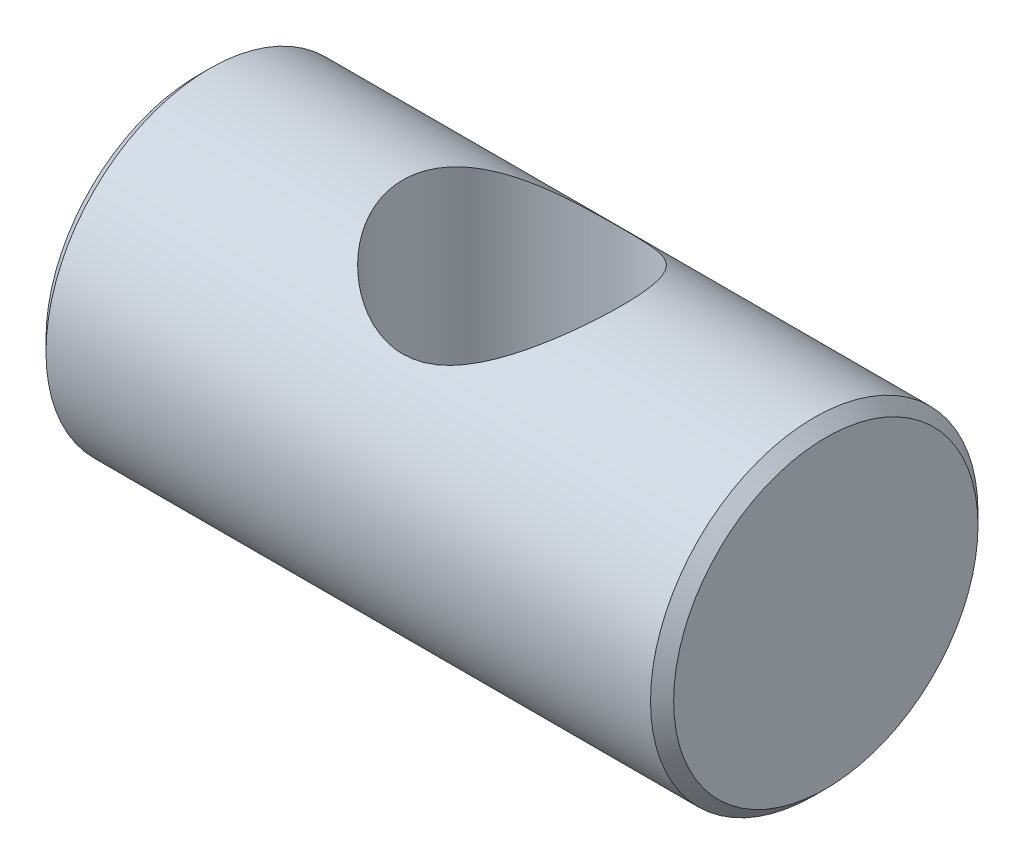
ISO-10303-21;
HEADER;
FILE_DESCRIPTION(('STEP AP214'),'2;1');
FILE_NAME('part.step','',(''),(''),'','','');
FILE_SCHEMA(('AUTOMOTIVE_DESIGN { 1 0 10303 214 1 1 1 1 }'));
ENDSEC;
DATA;
#1=APPLICATION_CONTEXT('core data for automotive mechanical design processes');
#2=APPLICATION_PROTOCOL_DEFINITION('international standard','automotive_design',2000,#1);
#3=PRODUCT_CONTEXT('',#1,'mechanical');
#4=PRODUCT('Part','Part','',(#3));
#5=PRODUCT_RELATED_PRODUCT_CATEGORY('part','',(#4));
#6=PRODUCT_DEFINITION_FORMATION('','',#4);
#7=PRODUCT_DEFINITION_CONTEXT('part definition',#1,'design');
#8=PRODUCT_DEFINITION('design','',#6,#7);
#9=PRODUCT_DEFINITION_SHAPE('','',#8);
#10=(LENGTH_UNIT() NAMED_UNIT(*) SI_UNIT(.MILLI.,.METRE.));
#11=(NAMED_UNIT(*) PLANE_ANGLE_UNIT() SI_UNIT($,.RADIAN.));
#12=(NAMED_UNIT(*) SI_UNIT($,.STERADIAN.) SOLID_ANGLE_UNIT());
#13=UNCERTAINTY_MEASURE_WITH_UNIT(LENGTH_MEASURE(1.E-05),#10,'distance_accuracy_value','');
#14=(GEOMETRIC_REPRESENTATION_CONTEXT(3) GLOBAL_UNCERTAINTY_ASSIGNED_CONTEXT((#13)) GLOBAL_UNIT_ASSIGNED_CONTEXT((#10,
#11,#12)) REPRESENTATION_CONTEXT('',''));
#15=CARTESIAN_POINT('',(0.,0.,0.));
#16=DIRECTION('',(0.,0.,1.));
#17=DIRECTION('',(1.,0.,0.));
#18=AXIS2_PLACEMENT_3D('',#15,#16,#17);
#19=CARTESIAN_POINT('',(5.75,2.78786796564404,0.));
#20=DIRECTION('',(-1.,0.,0.));
#21=DIRECTION('',(0.,0.,1.));
#22=AXIS2_PLACEMENT_3D('',#19,#20,#21);
#23=PLANE('',#22);
#24=CARTESIAN_POINT('',(5.74999999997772,0.,0.));
#25=DIRECTION('',(-1.,0.,0.));
#26=DIRECTION('',(0.,0.,1.));
#27=AXIS2_PLACEMENT_3D('',#24,#25,#26);
#28=CIRCLE('',#27,2.78786796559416);
#29=CARTESIAN_POINT('',(5.74999999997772,0.,2.78786796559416));
#30=VERTEX_POINT('',#29);
#31=EDGE_CURVE('E43',#30,#30,#28,.T.);
#32=ORIENTED_EDGE('',*,*,#31,.F.);
#33=EDGE_LOOP('',(#32));
#34=FACE_BOUND('',#33,.T.);
#35=ADVANCED_FACE('F12',(#34),#23,.F.);
#36=CARTESIAN_POINT('',(-5.75,0.,0.));
#37=DIRECTION('',(1.,0.,0.));
#38=DIRECTION('',(0.,0.,-1.));
#39=AXIS2_PLACEMENT_3D('',#36,#37,#38);
#40=PLANE('',#39);
#41=CARTESIAN_POINT('',(-5.75000000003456,0.,0.));
#42=DIRECTION('',(1.,0.,0.));
#43=DIRECTION('',(0.,0.,-1.));
#44=AXIS2_PLACEMENT_3D('',#41,#42,#43);
#45=CIRCLE('',#44,2.78786796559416);
#46=CARTESIAN_POINT('',(-5.75000000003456,0.,-2.78786796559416));
#47=VERTEX_POINT('',#46);
#48=EDGE_CURVE('E70',#47,#47,#45,.T.);
#49=ORIENTED_EDGE('',*,*,#48,.F.);
#50=EDGE_LOOP('',(#49));
#51=FACE_BOUND('',#50,.T.);
#52=ADVANCED_FACE('F59',(#51),#40,.F.);
#53=CARTESIAN_POINT('',(5.53786796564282,0.,0.));
#54=DIRECTION('',(-1.,0.,0.));
#55=DIRECTION('',(0.,0.,1.));
#56=AXIS2_PLACEMENT_3D('',#53,#54,#55);
#57=CONICAL_SURFACE('',#56,2.99999999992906,0.785398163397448);
#58=CARTESIAN_POINT('',(5.53786796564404,0.,0.));
#59=DIRECTION('',(1.,0.,0.));
#60=DIRECTION('',(0.,0.,-1.));
#61=AXIS2_PLACEMENT_3D('',#58,#59,#60);
#62=CIRCLE('',#61,3.);
#63=CARTESIAN_POINT('',(5.53786796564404,0.,-3.));
#64=VERTEX_POINT('',#63);
#65=EDGE_CURVE('E37',#64,#64,#62,.F.);
#66=ORIENTED_EDGE('',*,*,#65,.F.);
#67=EDGE_LOOP('',(#66));
#68=FACE_BOUND('',#67,.T.);
#69=ORIENTED_EDGE('',*,*,#31,.T.);
#70=EDGE_LOOP('',(#69));
#71=FACE_BOUND('',#70,.T.);
#72=ADVANCED_FACE('F64',(#68,#71),#57,.T.);
#73=CARTESIAN_POINT('',(-5.53786796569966,0.,0.));
#74=DIRECTION('',(1.,0.,0.));
#75=DIRECTION('',(0.,0.,-1.));
#76=AXIS2_PLACEMENT_3D('',#73,#74,#75);
#77=CONICAL_SURFACE('',#76,2.99999999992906,0.785398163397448);
#78=ORIENTED_EDGE('',*,*,#48,.T.);
#79=EDGE_LOOP('',(#78));
#80=FACE_BOUND('',#79,.T.);
#81=CARTESIAN_POINT('',(-5.53786796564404,0.,0.));
#82=DIRECTION('',(1.,0.,0.));
#83=DIRECTION('',(0.,0.,-1.));
#84=AXIS2_PLACEMENT_3D('',#81,#82,#83);
#85=CIRCLE('',#84,3.);
#86=CARTESIAN_POINT('',(-5.53786796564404,0.,-3.));
#87=VERTEX_POINT('',#86);
#88=EDGE_CURVE('E31',#87,#87,#85,.T.);
#89=ORIENTED_EDGE('',*,*,#88,.F.);
#90=EDGE_LOOP('',(#89));
#91=FACE_BOUND('',#90,.T.);
#92=ADVANCED_FACE('F56',(#80,#91),#77,.T.);
#93=CARTESIAN_POINT('',(5.75,0.,0.));
#94=DIRECTION('',(1.,0.,0.));
#95=DIRECTION('',(0.,0.,-1.));
#96=AXIS2_PLACEMENT_3D('',#93,#94,#95);
#97=CYLINDRICAL_SURFACE('',#96,3.);
#98=CARTESIAN_POINT('',(2.,-3.,0.));
#99=CARTESIAN_POINT('',(2.00000054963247,-3.0000004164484,0.100484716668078));
#100=CARTESIAN_POINT('',(1.9923860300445,-2.99490802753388,0.200969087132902));
#101=CARTESIAN_POINT('',(1.96240313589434,-2.97504652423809,0.398733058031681));
#102=CARTESIAN_POINT('',(1.9400277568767,-2.96027281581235,0.496011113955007));
#103=CARTESIAN_POINT('',(1.88189228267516,-2.92250482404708,0.684212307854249));
#104=CARTESIAN_POINT('',(1.84619485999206,-2.89954905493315,0.775162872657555));
#105=CARTESIAN_POINT('',(1.7629366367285,-2.8472613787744,0.949415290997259));
#106=CARTESIAN_POINT('',(1.71537411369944,-2.8179285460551,1.03271603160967));
#107=CARTESIAN_POINT('',(1.60534306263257,-2.75227329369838,1.19728470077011));
#108=CARTESIAN_POINT('',(1.54195213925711,-2.71556897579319,1.27778030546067));
#109=CARTESIAN_POINT('',(1.40426995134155,-2.63982313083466,1.42772804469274));
#110=CARTESIAN_POINT('',(1.32996307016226,-2.60077830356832,1.49716405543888));
#111=CARTESIAN_POINT('',(1.15894763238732,-2.51728264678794,1.63422297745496));
#112=CARTESIAN_POINT('',(1.06055434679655,-2.47295067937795,1.6998318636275));
#113=CARTESIAN_POINT('',(0.85163662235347,-2.3908414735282,1.81350357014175));
#114=CARTESIAN_POINT('',(0.741133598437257,-2.35305295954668,1.86159673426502));
#115=CARTESIAN_POINT('',(0.543288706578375,-2.29976266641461,1.92674035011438));
#116=CARTESIAN_POINT('',(0.458471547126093,-2.28097627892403,1.94874447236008));
#117=CARTESIAN_POINT('',(0.285255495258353,-2.25257969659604,1.98150617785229));
#118=CARTESIAN_POINT('',(0.19686305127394,-2.24295368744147,1.99228314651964));
#119=CARTESIAN_POINT('',(0.0185252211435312,-2.23436605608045,2.00191364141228));
#120=CARTESIAN_POINT('',(-0.0714250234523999,-2.23544802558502,2.00071842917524));
#121=CARTESIAN_POINT('',(-0.249634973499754,-2.24819775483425,1.98637581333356));
#122=CARTESIAN_POINT('',(-0.337893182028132,-2.25987448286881,1.97321828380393));
#123=CARTESIAN_POINT('',(-0.506467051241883,-2.29127185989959,1.93664994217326));
#124=CARTESIAN_POINT('',(-0.58696133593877,-2.31061488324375,1.91371711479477));
#125=CARTESIAN_POINT('',(-0.743023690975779,-2.35509622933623,1.85870118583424));
#126=CARTESIAN_POINT('',(-0.818590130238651,-2.3802364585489,1.8266150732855));
#127=CARTESIAN_POINT('',(-0.979025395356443,-2.43964196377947,1.74673818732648));
#128=CARTESIAN_POINT('',(-1.06265990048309,-2.47472317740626,1.69708052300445));
#129=CARTESIAN_POINT('',(-1.22138339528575,-2.54691537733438,1.58668960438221));
#130=CARTESIAN_POINT('',(-1.29646165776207,-2.58402882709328,1.52594268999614));
#131=CARTESIAN_POINT('',(-1.45254254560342,-2.66543343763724,1.37981165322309));
#132=CARTESIAN_POINT('',(-1.53133404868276,-2.7095474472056,1.29193938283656));
#133=CARTESIAN_POINT('',(-1.67319649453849,-2.79218100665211,1.10200799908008));
#134=CARTESIAN_POINT('',(-1.73628214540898,-2.83070577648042,0.999962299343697));
#135=CARTESIAN_POINT('',(-1.83347771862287,-2.89145404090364,0.80485782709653));
#136=CARTESIAN_POINT('',(-1.87084336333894,-2.9153926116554,0.71395764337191));
#137=CARTESIAN_POINT('',(-1.93210492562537,-2.95507719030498,0.526036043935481));
#138=CARTESIAN_POINT('',(-1.95601222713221,-2.97083012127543,0.42901987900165));
#139=CARTESIAN_POINT('',(-1.98916116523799,-2.99275882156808,0.23098545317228));
#140=CARTESIAN_POINT('',(-1.99833946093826,-2.99889322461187,0.129951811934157));
#141=CARTESIAN_POINT('',(-2.00124708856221,-3.00083114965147,-0.0724415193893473));
#142=CARTESIAN_POINT('',(-1.99497750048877,-2.99663539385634,-0.173801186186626));
#143=CARTESIAN_POINT('',(-1.96837594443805,-2.97899589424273,-0.366455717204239));
#144=CARTESIAN_POINT('',(-1.94906270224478,-2.96622246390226,-0.457957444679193));
#145=CARTESIAN_POINT('',(-1.89840431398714,-2.93318449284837,-0.636116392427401));
#146=CARTESIAN_POINT('',(-1.86705724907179,-2.91291875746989,-0.722772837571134));
#147=CARTESIAN_POINT('',(-1.79134770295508,-2.86496352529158,-0.894664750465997));
#148=CARTESIAN_POINT('',(-1.74631184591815,-2.83689870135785,-0.979496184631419));
#149=CARTESIAN_POINT('',(-1.64556671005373,-2.77601855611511,-1.14068302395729));
#150=CARTESIAN_POINT('',(-1.58985083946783,-2.74320030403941,-1.21703314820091));
#151=CARTESIAN_POINT('',(-1.45939213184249,-2.6695454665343,-1.37185445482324));
#152=CARTESIAN_POINT('',(-1.38303373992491,-2.62826156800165,-1.44875187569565));
#153=CARTESIAN_POINT('',(-1.21888857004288,-2.54571173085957,-1.58933968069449));
#154=CARTESIAN_POINT('',(-1.13109396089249,-2.50444582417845,-1.6530209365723));
#155=CARTESIAN_POINT('',(-0.952857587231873,-2.4293967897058,-1.76124776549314));
#156=CARTESIAN_POINT('',(-0.863267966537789,-2.39527597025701,-1.80695636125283));
#157=CARTESIAN_POINT('',(-0.676127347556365,-2.33438974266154,-1.88496213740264));
#158=CARTESIAN_POINT('',(-0.578591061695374,-2.30761112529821,-1.91728345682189));
#159=CARTESIAN_POINT('',(-0.395435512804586,-2.26933208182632,-1.9623584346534));
#160=CARTESIAN_POINT('',(-0.310828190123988,-2.25594998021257,-1.97758597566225));
#161=CARTESIAN_POINT('',(-0.139426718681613,-2.23879466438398,-1.99699205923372));
#162=CARTESIAN_POINT('',(-0.0526350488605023,-2.23501101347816,-2.00118260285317));
#163=CARTESIAN_POINT('',(0.120643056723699,-2.23764201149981,-1.99823921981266));
#164=CARTESIAN_POINT('',(0.207129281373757,-2.24406269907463,-1.99109858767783));
#165=CARTESIAN_POINT('',(0.377343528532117,-2.26610452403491,-1.96596997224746));
#166=CARTESIAN_POINT('',(0.461067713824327,-2.28173793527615,-1.94796751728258));
#167=CARTESIAN_POINT('',(0.645711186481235,-2.32526843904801,-1.89593035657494));
#168=CARTESIAN_POINT('',(0.745267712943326,-2.35532333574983,-1.85890187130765));
#169=CARTESIAN_POINT('',(0.935486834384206,-2.42222161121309,-1.7708452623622));
#170=CARTESIAN_POINT('',(1.02613669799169,-2.45907449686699,-1.71979748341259));
#171=CARTESIAN_POINT('',(1.19928188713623,-2.53617186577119,-1.60398280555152));
#172=CARTESIAN_POINT('',(1.28159874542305,-2.5764658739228,-1.53898309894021));
#173=CARTESIAN_POINT('',(1.43532247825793,-2.65628301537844,-1.39671768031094));
#174=CARTESIAN_POINT('',(1.50672599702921,-2.69580590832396,-1.31944821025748));
#175=CARTESIAN_POINT('',(1.64671210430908,-2.77631551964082,-1.14145732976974));
#176=CARTESIAN_POINT('',(1.71341864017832,-2.81669805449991,-1.03896166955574));
#177=CARTESIAN_POINT('',(1.8279132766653,-2.88777665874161,-0.820868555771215));
#178=CARTESIAN_POINT('',(1.87573110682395,-2.91848793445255,-0.705292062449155));
#179=CARTESIAN_POINT('',(1.94115457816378,-2.96101644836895,-0.491435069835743));
#180=CARTESIAN_POINT('',(1.96311103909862,-2.97551480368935,-0.395012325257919));
#181=CARTESIAN_POINT('',(1.9925280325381,-2.99500280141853,-0.199058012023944));
#182=CARTESIAN_POINT('',(1.99999945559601,-2.99999958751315,-0.099528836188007));
#183=CARTESIAN_POINT('',(2.,-3.,0.));
#184=B_SPLINE_CURVE_WITH_KNOTS('',3,(#98,#99,#100,#101,#102,#103,#104,#105,#106,#107,#108,#109,
#110,#111,#112,#113,#114,#115,#116,#117,#118,#119,#120,#121,#122,#123,#124,#125,#126,#127,#128,
#129,#130,#131,#132,#133,#134,#135,#136,#137,#138,#139,#140,#141,#142,#143,#144,#145,#146,#147,
#148,#149,#150,#151,#152,#153,#154,#155,#156,#157,#158,#159,#160,#161,#162,#163,#164,#165,#166,
#167,#168,#169,#170,#171,#172,#173,#174,#175,#176,#177,#178,#179,#180,#181,#182,#183),
.UNSPECIFIED.,.T.,.F.,(4,2,2,2,2,2,2,2,2,2,2,2,2,2,2,2,2,2,2,2,2,2,2,2,2,2,2,2,2,2,2,2,2,2,2,2,
2,2,2,2,2,2,4),(0.,0.3010532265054,0.602249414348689,0.902046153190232,1.20188643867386,
1.52717029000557,1.85292411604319,2.23006683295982,2.60655305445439,2.87433693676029,
3.14165767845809,3.41006711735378,3.67870397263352,3.93548862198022,4.19235783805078,
4.50147574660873,4.81097703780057,5.18718954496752,5.56304840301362,5.86524087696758,
6.16717735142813,6.47040883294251,6.77361911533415,7.05553084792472,7.3374875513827,
7.63652346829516,7.93574454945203,8.28228176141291,8.62905753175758,8.94649935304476,
9.26336626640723,9.52324048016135,9.78283200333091,10.0425772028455,10.302669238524,
10.6320660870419,10.9619271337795,11.2977924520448,11.6337608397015,12.0179535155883,
12.4015390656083,12.6999529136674,12.9981423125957),.UNSPECIFIED.);
#185=CARTESIAN_POINT('',(2.,-3.,0.));
#186=VERTEX_POINT('',#185);
#187=EDGE_CURVE('E8',#186,#186,#184,.T.);
#188=ORIENTED_EDGE('',*,*,#187,.F.);
#189=EDGE_LOOP('',(#188));
#190=FACE_BOUND('',#189,.T.);
#191=CARTESIAN_POINT('',(0.,2.23606797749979,2.));
#192=CARTESIAN_POINT('',(0.0976283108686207,2.23607753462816,1.99999453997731));
#193=CARTESIAN_POINT('',(0.195290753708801,2.24258071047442,1.99278992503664));
#194=CARTESIAN_POINT('',(0.387119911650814,2.26731972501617,1.96458268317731));
#195=CARTESIAN_POINT('',(0.481280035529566,2.2855766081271,1.94355530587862));
#196=CARTESIAN_POINT('',(0.662735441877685,2.3305658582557,1.88935861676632));
#197=CARTESIAN_POINT('',(0.750087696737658,2.35721561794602,1.85630718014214));
#198=CARTESIAN_POINT('',(0.917865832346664,2.41584094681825,1.77934008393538));
#199=CARTESIAN_POINT('',(0.998290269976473,2.44781762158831,1.73542216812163));
#200=CARTESIAN_POINT('',(1.16364688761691,2.51946072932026,1.63002410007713));
#201=CARTESIAN_POINT('',(1.2473321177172,2.55954936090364,1.56687435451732));
#202=CARTESIAN_POINT('',(1.40400270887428,2.63944827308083,1.4281921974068));
#203=CARTESIAN_POINT('',(1.47697752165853,2.67925824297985,1.3526477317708));
#204=CARTESIAN_POINT('',(1.62064365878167,2.76088818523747,1.17815690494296));
#205=CARTESIAN_POINT('',(1.68948251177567,2.80216785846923,1.07740643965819));
#206=CARTESIAN_POINT('',(1.80864209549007,2.87558484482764,0.862470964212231));
#207=CARTESIAN_POINT('',(1.85898351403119,2.90773236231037,0.748301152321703));
#208=CARTESIAN_POINT('',(1.93355640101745,2.95599907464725,0.523249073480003));
#209=CARTESIAN_POINT('',(1.96008334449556,2.97351175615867,0.413434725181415));
#210=CARTESIAN_POINT('',(1.99418448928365,2.99609745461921,0.189695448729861));
#211=CARTESIAN_POINT('',(2.00178255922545,3.00118613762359,0.0757758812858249));
#212=CARTESIAN_POINT('',(1.99782755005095,2.99855361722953,-0.134147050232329));
#213=CARTESIAN_POINT('',(1.98901094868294,2.99266264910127,-0.230240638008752));
#214=CARTESIAN_POINT('',(1.95790894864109,2.9720818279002,-0.419238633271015));
#215=CARTESIAN_POINT('',(1.93562256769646,2.95739133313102,-0.512142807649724));
#216=CARTESIAN_POINT('',(1.87880431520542,2.92052091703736,-0.692077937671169));
#217=CARTESIAN_POINT('',(1.84432111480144,2.89837077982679,-0.779130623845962));
#218=CARTESIAN_POINT('',(1.76444635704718,2.84821104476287,-0.946209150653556));
#219=CARTESIAN_POINT('',(1.71905280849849,2.82020037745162,-1.0262337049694));
#220=CARTESIAN_POINT('',(1.61202126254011,2.75618058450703,-1.18828429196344));
#221=CARTESIAN_POINT('',(1.54903247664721,2.71960408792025,-1.26919148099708));
#222=CARTESIAN_POINT('',(1.41210132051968,2.64400601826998,-1.41998807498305));
#223=CARTESIAN_POINT('',(1.33814205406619,2.60498072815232,-1.48986013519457));
#224=CARTESIAN_POINT('',(1.16803678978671,2.52150044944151,-1.62772235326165));
#225=CARTESIAN_POINT('',(1.07022892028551,2.47714320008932,-1.69373593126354));
#226=CARTESIAN_POINT('',(0.862490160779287,2.39475610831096,-1.80834874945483));
#227=CARTESIAN_POINT('',(0.752580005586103,2.3567157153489,-1.85697718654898));
#228=CARTESIAN_POINT('',(0.555280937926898,2.30262870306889,-1.92332724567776));
#229=CARTESIAN_POINT('',(0.470406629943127,2.28340364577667,-1.94590791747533));
#230=CARTESIAN_POINT('',(0.296960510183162,2.25409039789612,-1.97979555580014));
#231=CARTESIAN_POINT('',(0.208395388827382,2.24398636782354,-1.99112206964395));
#232=CARTESIAN_POINT('',(0.0295570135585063,2.23447556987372,-2.00179400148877));
#233=CARTESIAN_POINT('',(-0.0607219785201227,2.2351153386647,-2.00108729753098));
#234=CARTESIAN_POINT('',(-0.239683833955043,2.24709880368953,-1.98761629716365));
#235=CARTESIAN_POINT('',(-0.328365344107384,2.25845117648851,-1.97484222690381));
#236=CARTESIAN_POINT('',(-0.497389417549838,2.28927977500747,-1.93899811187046));
#237=CARTESIAN_POINT('',(-0.577927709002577,2.30833187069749,-1.91646174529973));
#238=CARTESIAN_POINT('',(-0.734126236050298,2.3522995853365,-1.86223041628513));
#239=CARTESIAN_POINT('',(-0.809784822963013,2.3772171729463,-1.83053237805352));
#240=CARTESIAN_POINT('',(-0.970202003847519,2.43611483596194,-1.75163346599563));
#241=CARTESIAN_POINT('',(-1.05375681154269,2.47091081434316,-1.70260028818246));
#242=CARTESIAN_POINT('',(-1.21241680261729,2.54262514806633,-1.59352731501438));
#243=CARTESIAN_POINT('',(-1.28751151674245,2.57954604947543,-1.53347411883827));
#244=CARTESIAN_POINT('',(-1.44396234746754,2.66075678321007,-1.38876657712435));
#245=CARTESIAN_POINT('',(-1.52310284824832,2.70489452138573,-1.30160386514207));
#246=CARTESIAN_POINT('',(-1.66581668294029,2.78775581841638,-1.11309948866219));
#247=CARTESIAN_POINT('',(-1.72940377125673,2.82648414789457,-1.011770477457));
#248=CARTESIAN_POINT('',(-1.82789173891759,2.88790821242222,-0.817487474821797));
#249=CARTESIAN_POINT('',(-1.86595650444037,2.91225458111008,-0.72666236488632));
#250=CARTESIAN_POINT('',(-1.92860719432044,2.95278707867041,-0.538757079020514));
#251=CARTESIAN_POINT('',(-1.95320450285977,2.96898009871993,-0.44168226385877));
#252=CARTESIAN_POINT('',(-1.98769696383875,2.99178364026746,-0.243369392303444));
#253=CARTESIAN_POINT('',(-1.99752667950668,2.99835150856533,-0.142114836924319));
#254=CARTESIAN_POINT('',(-2.0016478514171,3.00109821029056,0.0608555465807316));
#255=CARTESIAN_POINT('',(-1.99594075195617,2.99727800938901,0.162571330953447));
#256=CARTESIAN_POINT('',(-1.9703405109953,2.98029555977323,0.355757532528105));
#257=CARTESIAN_POINT('',(-1.95150901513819,2.96783277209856,0.447435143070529));
#258=CARTESIAN_POINT('',(-1.9017619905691,2.93536106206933,0.626018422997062));
#259=CARTESIAN_POINT('',(-1.87084458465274,2.91535096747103,0.71292334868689));
#260=CARTESIAN_POINT('',(-1.79606129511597,2.86791765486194,0.885147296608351));
#261=CARTESIAN_POINT('',(-1.75154969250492,2.84013248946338,0.970083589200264));
#262=CARTESIAN_POINT('',(-1.65184935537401,2.77975408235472,1.13155266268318));
#263=CARTESIAN_POINT('',(-1.596654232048,2.74715796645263,1.20808037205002));
#264=CARTESIAN_POINT('',(-1.46737109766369,2.67392931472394,1.36329422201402));
#265=CARTESIAN_POINT('',(-1.39167697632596,2.6328391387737,1.44042679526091));
#266=CARTESIAN_POINT('',(-1.22888645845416,2.55053357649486,1.58160022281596));
#267=CARTESIAN_POINT('',(-1.14178161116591,2.50931811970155,1.64563128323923));
#268=CARTESIAN_POINT('',(-0.964132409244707,2.43384213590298,1.75513253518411));
#269=CARTESIAN_POINT('',(-0.874358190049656,2.39929086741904,1.8016464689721));
#270=CARTESIAN_POINT('',(-0.68671555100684,2.33747501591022,1.88115802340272));
#271=CARTESIAN_POINT('',(-0.588863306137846,2.31019631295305,1.91418190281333));
#272=CARTESIAN_POINT('',(-0.409228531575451,2.27191051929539,1.95936262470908));
#273=CARTESIAN_POINT('',(-0.328691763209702,2.25863695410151,1.97452228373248));
#274=CARTESIAN_POINT('',(-0.165443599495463,2.24071519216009,1.99483915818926));
#275=CARTESIAN_POINT('',(-0.0827340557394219,2.23605987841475,2.00000462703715));
#276=CARTESIAN_POINT('',(0.,2.23606797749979,2.));
#277=B_SPLINE_CURVE_WITH_KNOTS('',3,(#191,#192,#193,#194,#195,#196,#197,#198,#199,#200,#201,
#202,#203,#204,#205,#206,#207,#208,#209,#210,#211,#212,#213,#214,#215,#216,#217,#218,#219,#220,
#221,#222,#223,#224,#225,#226,#227,#228,#229,#230,#231,#232,#233,#234,#235,#236,#237,#238,#239,
#240,#241,#242,#243,#244,#245,#246,#247,#248,#249,#250,#251,#252,#253,#254,#255,#256,#257,#258,
#259,#260,#261,#262,#263,#264,#265,#266,#267,#268,#269,#270,#271,#272,#273,#274,#275,#276),
.UNSPECIFIED.,.T.,.F.,(4,2,2,2,2,2,2,2,2,2,2,2,2,2,2,2,2,2,2,2,2,2,2,2,2,2,2,2,2,2,2,2,2,2,2,2,
2,2,2,2,2,2,4),(0.,0.292506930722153,0.585539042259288,0.875772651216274,1.16606657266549,
1.50154677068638,1.83735518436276,2.22167031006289,2.6055542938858,2.9463748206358,
3.28676536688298,3.57539534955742,3.86404638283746,4.15155831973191,4.43912276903,
4.76447525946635,5.09033414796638,5.46678703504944,5.84260469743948,6.11126090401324,
6.37944966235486,6.64880037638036,6.91836943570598,7.17476451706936,7.43124577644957,
7.73899230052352,8.04711556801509,8.42254684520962,8.7976449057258,9.10070580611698,
9.40351012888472,9.70765229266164,10.0117661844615,10.2937678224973,10.5758132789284,
10.874178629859,11.1727229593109,11.5182220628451,11.863978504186,12.1833412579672,
12.5020793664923,12.7501661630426,12.9980479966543),.UNSPECIFIED.);
#278=CARTESIAN_POINT('',(0.,2.23606797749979,2.));
#279=VERTEX_POINT('',#278);
#280=EDGE_CURVE('E24',#279,#279,#277,.T.);
#281=ORIENTED_EDGE('',*,*,#280,.F.);
#282=EDGE_LOOP('',(#281));
#283=FACE_BOUND('',#282,.T.);
#284=ORIENTED_EDGE('',*,*,#88,.T.);
#285=EDGE_LOOP('',(#284));
#286=FACE_BOUND('',#285,.T.);
#287=ORIENTED_EDGE('',*,*,#65,.T.);
#288=EDGE_LOOP('',(#287));
#289=FACE_BOUND('',#288,.T.);
#290=ADVANCED_FACE('F45',(#190,#283,#286,#289),#97,.T.);
#291=CARTESIAN_POINT('',(0.,-3.,0.));
#292=DIRECTION('',(0.,1.,0.));
#293=DIRECTION('',(0.,0.,1.));
#294=AXIS2_PLACEMENT_3D('',#291,#292,#293);
#295=CYLINDRICAL_SURFACE('',#294,2.);
#296=ORIENTED_EDGE('',*,*,#187,.T.);
#297=EDGE_LOOP('',(#296));
#298=FACE_BOUND('',#297,.T.);
#299=ORIENTED_EDGE('',*,*,#280,.T.);
#300=EDGE_LOOP('',(#299));
#301=FACE_BOUND('',#300,.T.);
#302=ADVANCED_FACE('F48',(#298,#301),#295,.F.);
#303=CLOSED_SHELL('',(#35,#52,#72,#92,#290,#302));
#304=MANIFOLD_SOLID_BREP('B1',#303);
#305=ADVANCED_BREP_SHAPE_REPRESENTATION('',(#18,#304),#14);
#306=SHAPE_DEFINITION_REPRESENTATION(#9,#305);
ENDSEC;
END-ISO-10303-21;
